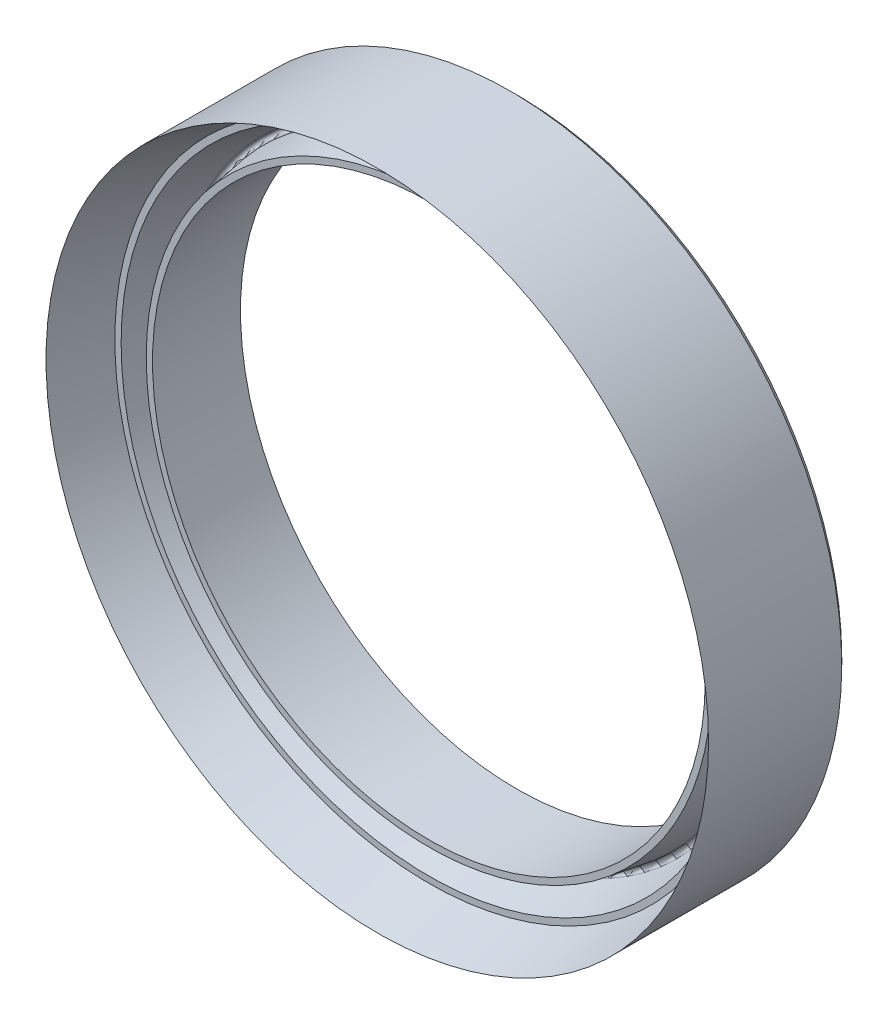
ISO-10303-21;
HEADER;
FILE_DESCRIPTION(('STEP AP214'),'2;1');
FILE_NAME('part.step','',(''),(''),'','','');
FILE_SCHEMA(('AUTOMOTIVE_DESIGN { 1 0 10303 214 1 1 1 1 }'));
ENDSEC;
DATA;
#1=APPLICATION_CONTEXT('core data for automotive mechanical design processes');
#2=APPLICATION_PROTOCOL_DEFINITION('international standard','automotive_design',2000,#1);
#3=PRODUCT_CONTEXT('',#1,'mechanical');
#4=PRODUCT('Part','Part','',(#3));
#5=PRODUCT_RELATED_PRODUCT_CATEGORY('part','',(#4));
#6=PRODUCT_DEFINITION_FORMATION('','',#4);
#7=PRODUCT_DEFINITION_CONTEXT('part definition',#1,'design');
#8=PRODUCT_DEFINITION('design','',#6,#7);
#9=PRODUCT_DEFINITION_SHAPE('','',#8);
#10=(LENGTH_UNIT() NAMED_UNIT(*) SI_UNIT(.MILLI.,.METRE.));
#11=(NAMED_UNIT(*) PLANE_ANGLE_UNIT() SI_UNIT($,.RADIAN.));
#12=(NAMED_UNIT(*) SI_UNIT($,.STERADIAN.) SOLID_ANGLE_UNIT());
#13=UNCERTAINTY_MEASURE_WITH_UNIT(LENGTH_MEASURE(1.E-05),#10,'distance_accuracy_value','');
#14=(GEOMETRIC_REPRESENTATION_CONTEXT(3) GLOBAL_UNCERTAINTY_ASSIGNED_CONTEXT((#13)) GLOBAL_UNIT_ASSIGNED_CONTEXT((#10,
#11,#12)) REPRESENTATION_CONTEXT('',''));
#15=CARTESIAN_POINT('',(0.,0.,0.));
#16=DIRECTION('',(0.,0.,1.));
#17=DIRECTION('',(1.,0.,0.));
#18=AXIS2_PLACEMENT_3D('',#15,#16,#17);
#19=CARTESIAN_POINT('',(0.,0.,20.));
#20=DIRECTION('',(0.,0.,1.));
#21=DIRECTION('',(1.00000000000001,0.,0.));
#22=AXIS2_PLACEMENT_3D('',#19,#20,#21);
#23=CYLINDRICAL_SURFACE('',#22,22.);
#24=CARTESIAN_POINT('',(0.,-1.11022302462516E-13,-7.00000000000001));
#25=DIRECTION('',(0.,0.,1.));
#26=DIRECTION('',(1.00000000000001,0.,0.));
#27=AXIS2_PLACEMENT_3D('',#24,#25,#26);
#28=CIRCLE('',#27,22.);
#29=CARTESIAN_POINT('',(22.0000000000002,-1.09343686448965E-13,-7.00000000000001));
#30=VERTEX_POINT('',#29);
#31=EDGE_CURVE('E44',#30,#30,#28,.T.);
#32=ORIENTED_EDGE('',*,*,#31,.F.);
#33=EDGE_LOOP('',(#32));
#34=FACE_BOUND('',#33,.T.);
#35=CARTESIAN_POINT('',(0.,0.,0.));
#36=DIRECTION('',(0.,0.,1.));
#37=DIRECTION('',(1.00000000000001,0.,0.));
#38=AXIS2_PLACEMENT_3D('',#35,#36,#37);
#39=CIRCLE('',#38,22.);
#40=CARTESIAN_POINT('',(22.0000000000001,0.,0.));
#41=VERTEX_POINT('',#40);
#42=EDGE_CURVE('E68',#41,#41,#39,.T.);
#43=ORIENTED_EDGE('',*,*,#42,.T.);
#44=EDGE_LOOP('',(#43));
#45=FACE_BOUND('',#44,.T.);
#46=ADVANCED_FACE('F34',(#34,#45),#23,.F.);
#47=CARTESIAN_POINT('',(1.38777878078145E-13,26.368750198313,-6.99999999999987));
#48=DIRECTION('',(0.,0.,1.));
#49=DIRECTION('',(1.00000000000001,0.,0.));
#50=AXIS2_PLACEMENT_3D('',#47,#48,#49);
#51=PLANE('',#50);
#52=CARTESIAN_POINT('',(0.,-1.11022302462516E-13,-7.00000000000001));
#53=DIRECTION('',(0.,0.,1.));
#54=DIRECTION('',(1.00000000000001,0.,0.));
#55=AXIS2_PLACEMENT_3D('',#52,#53,#54);
#56=CIRCLE('',#55,25.8687501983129);
#57=CARTESIAN_POINT('',(25.8687501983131,-1.09048497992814E-13,-7.00000000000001));
#58=VERTEX_POINT('',#57);
#59=EDGE_CURVE('E12',#58,#58,#56,.F.);
#60=ORIENTED_EDGE('',*,*,#59,.T.);
#61=EDGE_LOOP('',(#60));
#62=FACE_BOUND('',#61,.T.);
#63=ORIENTED_EDGE('',*,*,#31,.T.);
#64=EDGE_LOOP('',(#63));
#65=FACE_BOUND('',#64,.T.);
#66=ADVANCED_FACE('F112',(#62,#65),#51,.F.);
#67=CARTESIAN_POINT('',(0.,0.,20.));
#68=DIRECTION('',(0.,0.,1.));
#69=DIRECTION('',(1.00000000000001,0.,0.));
#70=AXIS2_PLACEMENT_3D('',#67,#68,#69);
#71=CYLINDRICAL_SURFACE('',#70,26.3687501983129);
#72=CARTESIAN_POINT('',(0.,-1.11022302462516E-13,-6.49999999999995));
#73=DIRECTION('',(0.,0.,1.));
#74=DIRECTION('',(1.00000000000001,0.,0.));
#75=AXIS2_PLACEMENT_3D('',#72,#73,#74);
#76=CIRCLE('',#75,26.3687501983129);
#77=CARTESIAN_POINT('',(26.3687501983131,-1.0901034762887E-13,-6.49999999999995));
#78=VERTEX_POINT('',#77);
#79=EDGE_CURVE('E40',#78,#78,#76,.T.);
#80=ORIENTED_EDGE('',*,*,#79,.T.);
#81=EDGE_LOOP('',(#80));
#82=FACE_BOUND('',#81,.T.);
#83=CARTESIAN_POINT('',(0.,0.,4.10625059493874));
#84=DIRECTION('',(0.,0.,1.));
#85=DIRECTION('',(1.00000000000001,0.,0.));
#86=AXIS2_PLACEMENT_3D('',#83,#84,#85);
#87=CIRCLE('',#86,26.3687501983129);
#88=CARTESIAN_POINT('',(26.368750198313,0.,4.10625059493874));
#89=VERTEX_POINT('',#88);
#90=EDGE_CURVE('E48',#89,#89,#87,.T.);
#91=ORIENTED_EDGE('',*,*,#90,.F.);
#92=EDGE_LOOP('',(#91));
#93=FACE_BOUND('',#92,.T.);
#94=ADVANCED_FACE('F107',(#82,#93),#71,.T.);
#95=CARTESIAN_POINT('',(0.,0.,4.10625059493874));
#96=DIRECTION('',(0.,0.,1.));
#97=DIRECTION('',(1.00000000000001,0.,0.));
#98=AXIS2_PLACEMENT_3D('',#95,#96,#97);
#99=CONICAL_SURFACE('',#98,26.3687501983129,0.321750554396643);
#100=CARTESIAN_POINT('',(0.,0.,0.));
#101=DIRECTION('',(0.,0.,1.));
#102=DIRECTION('',(1.00000000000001,0.,0.));
#103=AXIS2_PLACEMENT_3D('',#100,#101,#102);
#104=CIRCLE('',#103,25.);
#105=CARTESIAN_POINT('',(25.0000000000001,0.,0.));
#106=VERTEX_POINT('',#105);
#107=EDGE_CURVE('E53',#106,#106,#104,.T.);
#108=ORIENTED_EDGE('',*,*,#107,.F.);
#109=EDGE_LOOP('',(#108));
#110=FACE_BOUND('',#109,.T.);
#111=ORIENTED_EDGE('',*,*,#90,.T.);
#112=EDGE_LOOP('',(#111));
#113=FACE_BOUND('',#112,.T.);
#114=ADVANCED_FACE('F101',(#110,#113),#99,.F.);
#115=CARTESIAN_POINT('',(0.,24.5000000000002,2.4980018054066E-13));
#116=DIRECTION('',(0.,0.,-1.));
#117=DIRECTION('',(-1.00000000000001,0.,0.));
#118=AXIS2_PLACEMENT_3D('',#115,#116,#117);
#119=PLANE('',#118);
#120=CARTESIAN_POINT('',(0.,0.,0.));
#121=DIRECTION('',(0.,0.,1.));
#122=DIRECTION('',(1.00000000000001,0.,0.));
#123=AXIS2_PLACEMENT_3D('',#120,#121,#122);
#124=CIRCLE('',#123,24.5);
#125=CARTESIAN_POINT('',(24.5000000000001,0.,0.));
#126=VERTEX_POINT('',#125);
#127=EDGE_CURVE('E56',#126,#126,#124,.T.);
#128=ORIENTED_EDGE('',*,*,#127,.F.);
#129=EDGE_LOOP('',(#128));
#130=FACE_BOUND('',#129,.T.);
#131=ORIENTED_EDGE('',*,*,#107,.T.);
#132=EDGE_LOOP('',(#131));
#133=FACE_BOUND('',#132,.T.);
#134=ADVANCED_FACE('F95',(#130,#133),#119,.F.);
#135=CARTESIAN_POINT('',(0.,0.,0.));
#136=DIRECTION('',(0.,0.,1.));
#137=DIRECTION('',(1.00000000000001,0.,0.));
#138=AXIS2_PLACEMENT_3D('',#135,#136,#137);
#139=CONICAL_SURFACE('',#138,24.5,0.321750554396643);
#140=CARTESIAN_POINT('',(1.66533453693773E-13,0.,-3.12034993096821));
#141=DIRECTION('',(0.,0.,1.));
#142=DIRECTION('',(1.00000000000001,0.,0.));
#143=AXIS2_PLACEMENT_3D('',#140,#141,#142);
#144=CIRCLE('',#143,23.4598833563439);
#145=CARTESIAN_POINT('',(23.4598833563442,0.,-3.12034993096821));
#146=VERTEX_POINT('',#145);
#147=EDGE_CURVE('E59',#146,#146,#144,.T.);
#148=ORIENTED_EDGE('',*,*,#147,.F.);
#149=EDGE_LOOP('',(#148));
#150=FACE_BOUND('',#149,.T.);
#151=ORIENTED_EDGE('',*,*,#127,.T.);
#152=EDGE_LOOP('',(#151));
#153=FACE_BOUND('',#152,.T.);
#154=ADVANCED_FACE('F89',(#150,#153),#139,.F.);
#155=CARTESIAN_POINT('',(1.66533453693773E-13,0.,-3.04129298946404));
#156=DIRECTION('',(0.,0.,1.));
#157=DIRECTION('',(1.00000000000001,0.,0.));
#158=AXIS2_PLACEMENT_3D('',#155,#156,#157);
#159=TOROIDAL_SURFACE('',#158,23.2227125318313,0.25);
#160=CARTESIAN_POINT('',(1.66533453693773E-13,0.,-3.07945463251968));
#161=DIRECTION('',(0.,0.,1.));
#162=DIRECTION('',(1.00000000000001,0.,0.));
#163=AXIS2_PLACEMENT_3D('',#160,#161,#162);
#164=CIRCLE('',#163,22.9756423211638);
#165=CARTESIAN_POINT('',(22.9756423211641,0.,-3.07945463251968));
#166=VERTEX_POINT('',#165);
#167=EDGE_CURVE('E62',#166,#166,#164,.T.);
#168=ORIENTED_EDGE('',*,*,#167,.F.);
#169=EDGE_LOOP('',(#168));
#170=FACE_BOUND('',#169,.T.);
#171=ORIENTED_EDGE('',*,*,#147,.T.);
#172=EDGE_LOOP('',(#171));
#173=FACE_BOUND('',#172,.T.);
#174=ADVANCED_FACE('F83',(#170,#173),#159,.F.);
#175=CARTESIAN_POINT('',(1.66533453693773E-13,0.,-3.07945463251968));
#176=DIRECTION('',(0.,0.,-1.));
#177=DIRECTION('',(-1.00000000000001,0.,0.));
#178=AXIS2_PLACEMENT_3D('',#175,#176,#177);
#179=CONICAL_SURFACE('',#178,22.9756423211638,0.153245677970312);
#180=CARTESIAN_POINT('',(0.,0.,0.));
#181=DIRECTION('',(0.,0.,1.));
#182=DIRECTION('',(1.00000000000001,0.,0.));
#183=AXIS2_PLACEMENT_3D('',#180,#181,#182);
#184=CIRCLE('',#183,22.5000000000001);
#185=CARTESIAN_POINT('',(22.5000000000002,0.,0.));
#186=VERTEX_POINT('',#185);
#187=EDGE_CURVE('E65',#186,#186,#184,.T.);
#188=ORIENTED_EDGE('',*,*,#187,.F.);
#189=EDGE_LOOP('',(#188));
#190=FACE_BOUND('',#189,.T.);
#191=ORIENTED_EDGE('',*,*,#167,.T.);
#192=EDGE_LOOP('',(#191));
#193=FACE_BOUND('',#192,.T.);
#194=ADVANCED_FACE('F77',(#190,#193),#179,.T.);
#195=CARTESIAN_POINT('',(1.38777878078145E-13,22.0000000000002,2.77555756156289E-13));
#196=DIRECTION('',(0.,0.,-1.));
#197=DIRECTION('',(-1.00000000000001,0.,0.));
#198=AXIS2_PLACEMENT_3D('',#195,#196,#197);
#199=PLANE('',#198);
#200=ORIENTED_EDGE('',*,*,#42,.F.);
#201=EDGE_LOOP('',(#200));
#202=FACE_BOUND('',#201,.T.);
#203=ORIENTED_EDGE('',*,*,#187,.T.);
#204=EDGE_LOOP('',(#203));
#205=FACE_BOUND('',#204,.T.);
#206=ADVANCED_FACE('F73',(#202,#205),#199,.F.);
#207=CARTESIAN_POINT('',(0.,-1.11022302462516E-13,-6.49999999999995));
#208=DIRECTION('',(0.,0.,1.));
#209=DIRECTION('',(1.00000000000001,0.,0.));
#210=AXIS2_PLACEMENT_3D('',#207,#208,#209);
#211=CONICAL_SURFACE('',#210,26.3687501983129,0.785398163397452);
#212=ORIENTED_EDGE('',*,*,#59,.F.);
#213=EDGE_LOOP('',(#212));
#214=FACE_BOUND('',#213,.T.);
#215=ORIENTED_EDGE('',*,*,#79,.F.);
#216=EDGE_LOOP('',(#215));
#217=FACE_BOUND('',#216,.T.);
#218=ADVANCED_FACE('F76',(#214,#217),#211,.T.);
#219=CLOSED_SHELL('',(#46,#66,#94,#114,#134,#154,#174,#194,#206,#218));
#220=MANIFOLD_SOLID_BREP('B2',#219);
#221=ADVANCED_BREP_SHAPE_REPRESENTATION('',(#18,#220),#14);
#222=SHAPE_DEFINITION_REPRESENTATION(#9,#221);
ENDSEC;
END-ISO-10303-21;
